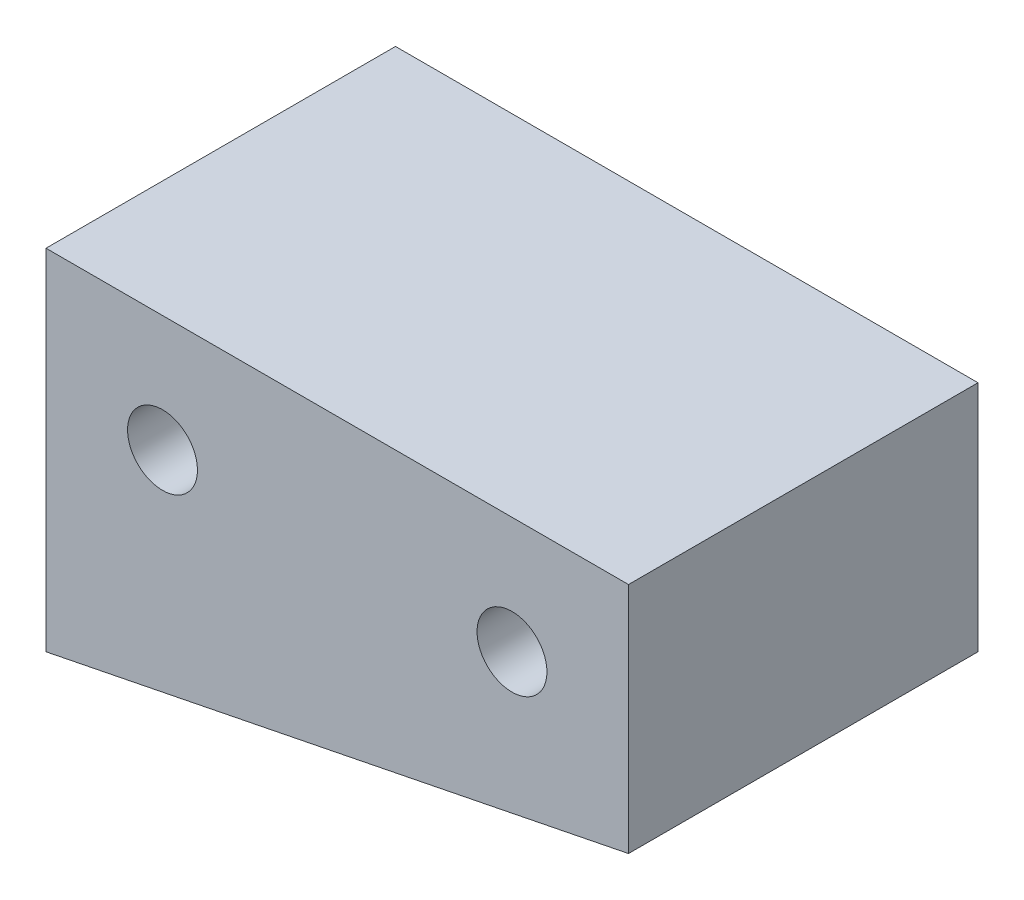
ISO-10303-21;
HEADER;
FILE_DESCRIPTION(('STEP AP214'),'2;1');
FILE_NAME('part.step','',(''),(''),'','','');
FILE_SCHEMA(('AUTOMOTIVE_DESIGN { 1 0 10303 214 1 1 1 1 }'));
ENDSEC;
DATA;
#1=APPLICATION_CONTEXT('core data for automotive mechanical design processes');
#2=APPLICATION_PROTOCOL_DEFINITION('international standard','automotive_design',2000,#1);
#3=PRODUCT_CONTEXT('',#1,'mechanical');
#4=PRODUCT('Part','Part','',(#3));
#5=PRODUCT_RELATED_PRODUCT_CATEGORY('part','',(#4));
#6=PRODUCT_DEFINITION_FORMATION('','',#4);
#7=PRODUCT_DEFINITION_CONTEXT('part definition',#1,'design');
#8=PRODUCT_DEFINITION('design','',#6,#7);
#9=PRODUCT_DEFINITION_SHAPE('','',#8);
#10=(LENGTH_UNIT() NAMED_UNIT(*) SI_UNIT(.MILLI.,.METRE.));
#11=(NAMED_UNIT(*) PLANE_ANGLE_UNIT() SI_UNIT($,.RADIAN.));
#12=(NAMED_UNIT(*) SI_UNIT($,.STERADIAN.) SOLID_ANGLE_UNIT());
#13=UNCERTAINTY_MEASURE_WITH_UNIT(LENGTH_MEASURE(1.E-05),#10,'distance_accuracy_value','');
#14=(GEOMETRIC_REPRESENTATION_CONTEXT(3) GLOBAL_UNCERTAINTY_ASSIGNED_CONTEXT((#13)) GLOBAL_UNIT_ASSIGNED_CONTEXT((#10,
#11,#12)) REPRESENTATION_CONTEXT('',''));
#15=CARTESIAN_POINT('',(0.,0.,0.));
#16=DIRECTION('',(0.,0.,1.));
#17=DIRECTION('',(1.,0.,0.));
#18=AXIS2_PLACEMENT_3D('',#15,#16,#17);
#19=CARTESIAN_POINT('',(0.,0.,15.));
#20=DIRECTION('',(1.,0.,0.));
#21=DIRECTION('',(0.,0.,-1.));
#22=AXIS2_PLACEMENT_3D('',#19,#20,#21);
#23=PLANE('',#22);
#24=DIRECTION('',(0.,-1.,0.));
#25=VECTOR('',#24,1.);
#26=CARTESIAN_POINT('',(0.,0.,0.));
#27=LINE('',#26,#25);
#28=CARTESIAN_POINT('',(0.,15.,0.));
#29=VERTEX_POINT('',#28);
#30=CARTESIAN_POINT('',(0.,0.,0.));
#31=VERTEX_POINT('',#30);
#32=EDGE_CURVE('E84',#29,#31,#27,.T.);
#33=ORIENTED_EDGE('',*,*,#32,.T.);
#34=DIRECTION('',(0.,0.,-1.));
#35=VECTOR('',#34,1.);
#36=CARTESIAN_POINT('',(0.,0.,15.));
#37=LINE('',#36,#35);
#38=CARTESIAN_POINT('',(0.,0.,15.));
#39=VERTEX_POINT('',#38);
#40=EDGE_CURVE('E69',#39,#31,#37,.T.);
#41=ORIENTED_EDGE('',*,*,#40,.F.);
#42=DIRECTION('',(0.,-1.,0.));
#43=VECTOR('',#42,1.);
#44=CARTESIAN_POINT('',(0.,0.,15.));
#45=LINE('',#44,#43);
#46=CARTESIAN_POINT('',(0.,15.,15.));
#47=VERTEX_POINT('',#46);
#48=EDGE_CURVE('E76',#47,#39,#45,.T.);
#49=ORIENTED_EDGE('',*,*,#48,.F.);
#50=DIRECTION('',(0.,0.,-1.));
#51=VECTOR('',#50,1.);
#52=CARTESIAN_POINT('',(0.,15.,15.));
#53=LINE('',#52,#51);
#54=EDGE_CURVE('E91',#47,#29,#53,.T.);
#55=ORIENTED_EDGE('',*,*,#54,.T.);
#56=EDGE_LOOP('',(#33,#41,#49,#55));
#57=FACE_BOUND('',#56,.T.);
#58=ADVANCED_FACE('F27',(#57),#23,.F.);
#59=CARTESIAN_POINT('',(25.,0.,15.));
#60=DIRECTION('',(-1.,0.,0.));
#61=DIRECTION('',(0.,0.,1.));
#62=AXIS2_PLACEMENT_3D('',#59,#60,#61);
#63=PLANE('',#62);
#64=DIRECTION('',(0.,1.,0.));
#65=VECTOR('',#64,1.);
#66=CARTESIAN_POINT('',(25.,0.,15.));
#67=LINE('',#66,#65);
#68=CARTESIAN_POINT('',(25.,5.00003064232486,15.));
#69=VERTEX_POINT('',#68);
#70=CARTESIAN_POINT('',(25.,15.,15.));
#71=VERTEX_POINT('',#70);
#72=EDGE_CURVE('E46',#69,#71,#67,.T.);
#73=ORIENTED_EDGE('',*,*,#72,.F.);
#74=DIRECTION('',(0.,0.,-1.));
#75=VECTOR('',#74,1.);
#76=CARTESIAN_POINT('',(25.,5.00003064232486,15.));
#77=LINE('',#76,#75);
#78=CARTESIAN_POINT('',(25.,5.00003064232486,0.));
#79=VERTEX_POINT('',#78);
#80=EDGE_CURVE('E72',#69,#79,#77,.T.);
#81=ORIENTED_EDGE('',*,*,#80,.T.);
#82=DIRECTION('',(0.,1.,0.));
#83=VECTOR('',#82,1.);
#84=CARTESIAN_POINT('',(25.,0.,0.));
#85=LINE('',#84,#83);
#86=CARTESIAN_POINT('',(25.,15.,0.));
#87=VERTEX_POINT('',#86);
#88=EDGE_CURVE('E120',#79,#87,#85,.T.);
#89=ORIENTED_EDGE('',*,*,#88,.T.);
#90=DIRECTION('',(0.,0.,-1.));
#91=VECTOR('',#90,1.);
#92=CARTESIAN_POINT('',(25.,15.,15.));
#93=LINE('',#92,#91);
#94=EDGE_CURVE('E86',#71,#87,#93,.T.);
#95=ORIENTED_EDGE('',*,*,#94,.F.);
#96=EDGE_LOOP('',(#73,#81,#89,#95));
#97=FACE_BOUND('',#96,.T.);
#98=ADVANCED_FACE('F122',(#97),#63,.F.);
#99=CARTESIAN_POINT('',(0.,15.,15.));
#100=DIRECTION('',(0.,-1.,0.));
#101=DIRECTION('',(0.,0.,-1.));
#102=AXIS2_PLACEMENT_3D('',#99,#100,#101);
#103=PLANE('',#102);
#104=DIRECTION('',(-1.,0.,0.));
#105=VECTOR('',#104,1.);
#106=CARTESIAN_POINT('',(0.,15.,0.));
#107=LINE('',#106,#105);
#108=EDGE_CURVE('E80',#87,#29,#107,.T.);
#109=ORIENTED_EDGE('',*,*,#108,.T.);
#110=ORIENTED_EDGE('',*,*,#54,.F.);
#111=DIRECTION('',(-1.,0.,0.));
#112=VECTOR('',#111,1.);
#113=CARTESIAN_POINT('',(0.,15.,15.));
#114=LINE('',#113,#112);
#115=EDGE_CURVE('E41',#71,#47,#114,.T.);
#116=ORIENTED_EDGE('',*,*,#115,.F.);
#117=ORIENTED_EDGE('',*,*,#94,.T.);
#118=EDGE_LOOP('',(#109,#110,#116,#117));
#119=FACE_BOUND('',#118,.T.);
#120=ADVANCED_FACE('F131',(#119),#103,.F.);
#121=CARTESIAN_POINT('',(0.,15.,15.));
#122=DIRECTION('',(0.,0.,-1.));
#123=DIRECTION('',(-1.,0.,0.));
#124=AXIS2_PLACEMENT_3D('',#121,#122,#123);
#125=PLANE('',#124);
#126=CARTESIAN_POINT('',(5.,10.0000153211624,15.));
#127=DIRECTION('',(0.,0.,1.));
#128=DIRECTION('',(1.,0.,0.));
#129=AXIS2_PLACEMENT_3D('',#126,#127,#128);
#130=CIRCLE('',#129,1.5);
#131=CARTESIAN_POINT('',(6.5,10.0000153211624,15.));
#132=VERTEX_POINT('',#131);
#133=EDGE_CURVE('E194',#132,#132,#130,.T.);
#134=ORIENTED_EDGE('',*,*,#133,.F.);
#135=EDGE_LOOP('',(#134));
#136=FACE_BOUND('',#135,.T.);
#137=CARTESIAN_POINT('',(20.,10.0000153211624,15.));
#138=DIRECTION('',(0.,0.,1.));
#139=DIRECTION('',(1.,0.,0.));
#140=AXIS2_PLACEMENT_3D('',#137,#138,#139);
#141=CIRCLE('',#140,1.5);
#142=CARTESIAN_POINT('',(21.5,10.0000153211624,15.));
#143=VERTEX_POINT('',#142);
#144=EDGE_CURVE('E73',#143,#143,#141,.T.);
#145=ORIENTED_EDGE('',*,*,#144,.F.);
#146=EDGE_LOOP('',(#145));
#147=FACE_BOUND('',#146,.T.);
#148=ORIENTED_EDGE('',*,*,#48,.T.);
#149=DIRECTION('',(-0.980580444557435,-0.196117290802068,0.));
#150=VECTOR('',#149,1.);
#151=CARTESIAN_POINT('',(0.,0.,15.));
#152=LINE('',#151,#150);
#153=EDGE_CURVE('E66',#69,#39,#152,.T.);
#154=ORIENTED_EDGE('',*,*,#153,.F.);
#155=ORIENTED_EDGE('',*,*,#72,.T.);
#156=ORIENTED_EDGE('',*,*,#115,.T.);
#157=EDGE_LOOP('',(#148,#154,#155,#156));
#158=FACE_BOUND('',#157,.T.);
#159=ADVANCED_FACE('F77',(#136,#147,#158),#125,.F.);
#160=CARTESIAN_POINT('',(0.,15.,0.));
#161=DIRECTION('',(0.,0.,-1.));
#162=DIRECTION('',(-1.,0.,0.));
#163=AXIS2_PLACEMENT_3D('',#160,#161,#162);
#164=PLANE('',#163);
#165=CARTESIAN_POINT('',(5.,10.0000153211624,0.));
#166=DIRECTION('',(0.,0.,-1.));
#167=DIRECTION('',(-1.,0.,0.));
#168=AXIS2_PLACEMENT_3D('',#165,#166,#167);
#169=CIRCLE('',#168,3.);
#170=CARTESIAN_POINT('',(2.,10.0000153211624,0.));
#171=VERTEX_POINT('',#170);
#172=EDGE_CURVE('E97',#171,#171,#169,.F.);
#173=ORIENTED_EDGE('',*,*,#172,.T.);
#174=EDGE_LOOP('',(#173));
#175=FACE_BOUND('',#174,.T.);
#176=CARTESIAN_POINT('',(20.,10.0000153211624,0.));
#177=DIRECTION('',(0.,0.,-1.));
#178=DIRECTION('',(-1.,0.,0.));
#179=AXIS2_PLACEMENT_3D('',#176,#177,#178);
#180=CIRCLE('',#179,3.);
#181=CARTESIAN_POINT('',(17.,10.0000153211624,0.));
#182=VERTEX_POINT('',#181);
#183=EDGE_CURVE('E88',#182,#182,#180,.F.);
#184=ORIENTED_EDGE('',*,*,#183,.T.);
#185=EDGE_LOOP('',(#184));
#186=FACE_BOUND('',#185,.T.);
#187=DIRECTION('',(0.980580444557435,0.196117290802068,0.));
#188=VECTOR('',#187,1.);
#189=CARTESIAN_POINT('',(2.88463170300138,0.576929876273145,0.));
#190=LINE('',#189,#188);
#191=EDGE_CURVE('E85',#31,#79,#190,.T.);
#192=ORIENTED_EDGE('',*,*,#191,.F.);
#193=ORIENTED_EDGE('',*,*,#32,.F.);
#194=ORIENTED_EDGE('',*,*,#108,.F.);
#195=ORIENTED_EDGE('',*,*,#88,.F.);
#196=EDGE_LOOP('',(#192,#193,#194,#195));
#197=FACE_BOUND('',#196,.T.);
#198=ADVANCED_FACE('F112',(#175,#186,#197),#164,.T.);
#199=CARTESIAN_POINT('',(0.,0.,0.));
#200=DIRECTION('',(-0.196117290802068,0.980580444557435,0.));
#201=DIRECTION('',(-0.980580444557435,-0.196117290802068,0.));
#202=AXIS2_PLACEMENT_3D('',#199,#200,#201);
#203=PLANE('',#202);
#204=ORIENTED_EDGE('',*,*,#153,.T.);
#205=ORIENTED_EDGE('',*,*,#40,.T.);
#206=ORIENTED_EDGE('',*,*,#191,.T.);
#207=ORIENTED_EDGE('',*,*,#80,.F.);
#208=EDGE_LOOP('',(#204,#205,#206,#207));
#209=FACE_BOUND('',#208,.T.);
#210=ADVANCED_FACE('F67',(#209),#203,.F.);
#211=CARTESIAN_POINT('',(20.,10.0000153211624,0.));
#212=DIRECTION('',(0.,0.,1.));
#213=DIRECTION('',(1.,0.,0.));
#214=AXIS2_PLACEMENT_3D('',#211,#212,#213);
#215=CYLINDRICAL_SURFACE('',#214,1.5);
#216=CARTESIAN_POINT('',(20.,10.0000153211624,1.5));
#217=DIRECTION('',(0.,0.,-1.));
#218=DIRECTION('',(-1.,0.,0.));
#219=AXIS2_PLACEMENT_3D('',#216,#217,#218);
#220=CIRCLE('',#219,1.5);
#221=CARTESIAN_POINT('',(18.5,10.0000153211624,1.5));
#222=VERTEX_POINT('',#221);
#223=EDGE_CURVE('E11',#222,#222,#220,.T.);
#224=ORIENTED_EDGE('',*,*,#223,.T.);
#225=EDGE_LOOP('',(#224));
#226=FACE_BOUND('',#225,.T.);
#227=ORIENTED_EDGE('',*,*,#144,.T.);
#228=EDGE_LOOP('',(#227));
#229=FACE_BOUND('',#228,.T.);
#230=ADVANCED_FACE('F152',(#226,#229),#215,.F.);
#231=CARTESIAN_POINT('',(5.,10.0000153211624,0.));
#232=DIRECTION('',(0.,0.,1.));
#233=DIRECTION('',(1.,0.,0.));
#234=AXIS2_PLACEMENT_3D('',#231,#232,#233);
#235=CYLINDRICAL_SURFACE('',#234,1.5);
#236=CARTESIAN_POINT('',(5.,10.0000153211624,1.50000000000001));
#237=DIRECTION('',(0.,0.,-1.));
#238=DIRECTION('',(-1.,0.,0.));
#239=AXIS2_PLACEMENT_3D('',#236,#237,#238);
#240=CIRCLE('',#239,1.5);
#241=CARTESIAN_POINT('',(3.5,10.0000153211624,1.50000000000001));
#242=VERTEX_POINT('',#241);
#243=EDGE_CURVE('E34',#242,#242,#240,.T.);
#244=ORIENTED_EDGE('',*,*,#243,.T.);
#245=EDGE_LOOP('',(#244));
#246=FACE_BOUND('',#245,.T.);
#247=ORIENTED_EDGE('',*,*,#133,.T.);
#248=EDGE_LOOP('',(#247));
#249=FACE_BOUND('',#248,.T.);
#250=ADVANCED_FACE('F102',(#246,#249),#235,.F.);
#251=CARTESIAN_POINT('',(5.,10.0000153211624,0.));
#252=DIRECTION('',(0.,0.,-1.));
#253=DIRECTION('',(-1.,0.,0.));
#254=AXIS2_PLACEMENT_3D('',#251,#252,#253);
#255=CONICAL_SURFACE('',#254,3.,0.785398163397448);
#256=ORIENTED_EDGE('',*,*,#243,.F.);
#257=EDGE_LOOP('',(#256));
#258=FACE_BOUND('',#257,.T.);
#259=ORIENTED_EDGE('',*,*,#172,.F.);
#260=EDGE_LOOP('',(#259));
#261=FACE_BOUND('',#260,.T.);
#262=ADVANCED_FACE('F105',(#258,#261),#255,.F.);
#263=CARTESIAN_POINT('',(20.,10.0000153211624,0.));
#264=DIRECTION('',(0.,0.,-1.));
#265=DIRECTION('',(-1.,0.,0.));
#266=AXIS2_PLACEMENT_3D('',#263,#264,#265);
#267=CONICAL_SURFACE('',#266,3.,0.785398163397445);
#268=ORIENTED_EDGE('',*,*,#223,.F.);
#269=EDGE_LOOP('',(#268));
#270=FACE_BOUND('',#269,.T.);
#271=ORIENTED_EDGE('',*,*,#183,.F.);
#272=EDGE_LOOP('',(#271));
#273=FACE_BOUND('',#272,.T.);
#274=ADVANCED_FACE('F108',(#270,#273),#267,.F.);
#275=CLOSED_SHELL('',(#58,#98,#120,#159,#198,#210,#230,#250,#262,#274));
#276=MANIFOLD_SOLID_BREP('B2',#275);
#277=ADVANCED_BREP_SHAPE_REPRESENTATION('',(#18,#276),#14);
#278=SHAPE_DEFINITION_REPRESENTATION(#9,#277);
ENDSEC;
END-ISO-10303-21;
